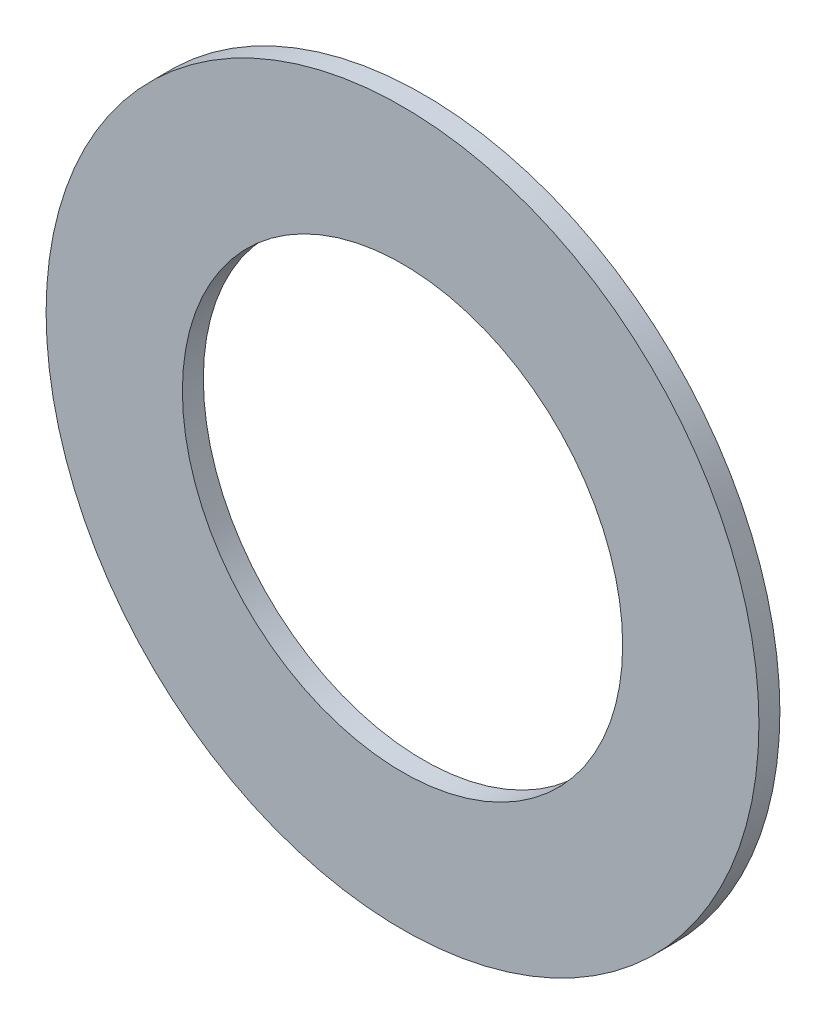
from build123d import *

# Parameters (mm, degrees)
ESQUISSE1_R          = 17
ESQUISSE1_R_2        = 10.5
BASE_EXTRUSION_DEPTH = 1


with BuildPart() as part:
    # Esquisse1 → Base-Extrusion (new body)
    with BuildSketch(Plane.XY):
        Circle(ESQUISSE1_R)
        Circle(ESQUISSE1_R_2, mode=Mode.SUBTRACT)
    extrude(amount=BASE_EXTRUSION_DEPTH)


solid = part.part
